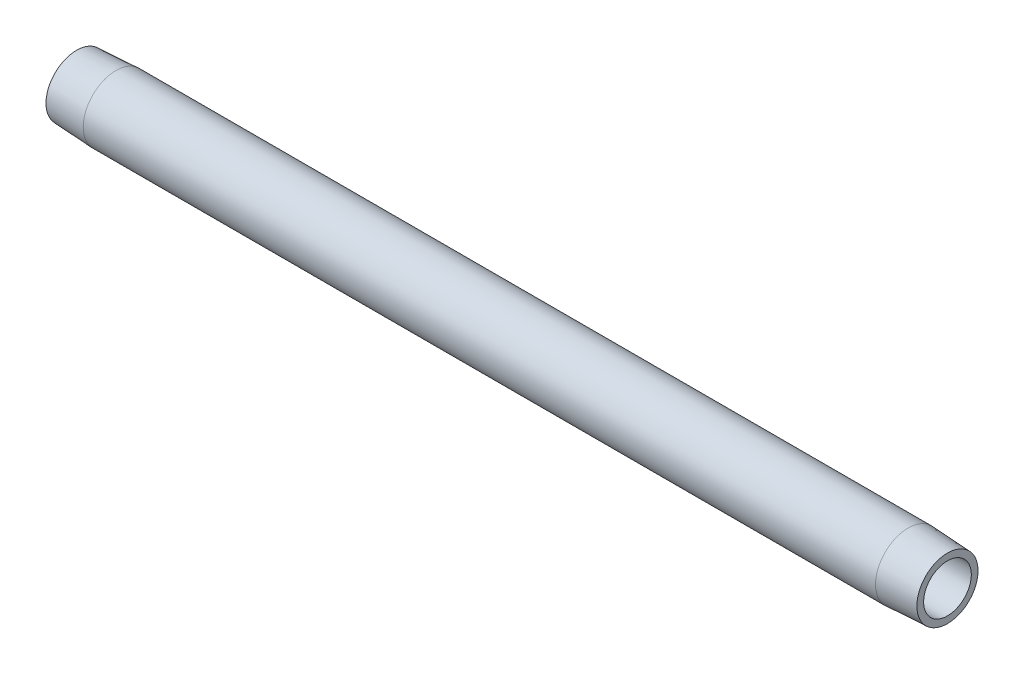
from build123d import *


with BuildPart() as part:
    # Sketch1 → Revolve1 (revolve)
    with BuildSketch(Plane.XY, mode=Mode.PRIVATE) as revolve1_sk:
        Polygon((228.6, 6.2611), (0, 6.2611), (0, 8.032050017), (10.3124, 8.5725), (218.2876, 8.5725), (228.6, 8.032050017), align=None)
    revolve(revolve1_sk.sketch.rotate(Axis((0, 0, 0), (1, 0, 0)), 90), axis=Axis((0, 0, 0), (1, 0, 0)))


solid = part.part
